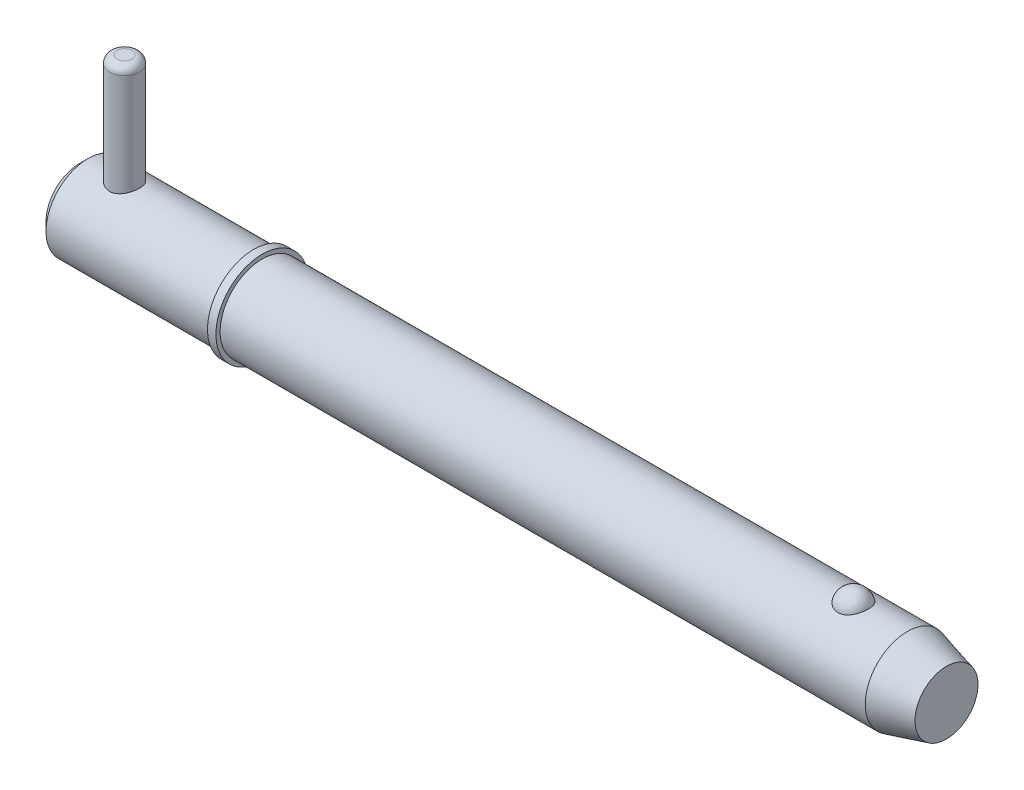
ISO-10303-21;
HEADER;
FILE_DESCRIPTION(('STEP AP214'),'2;1');
FILE_NAME('part.step','',(''),(''),'','','');
FILE_SCHEMA(('AUTOMOTIVE_DESIGN { 1 0 10303 214 1 1 1 1 }'));
ENDSEC;
DATA;
#1=APPLICATION_CONTEXT('core data for automotive mechanical design processes');
#2=APPLICATION_PROTOCOL_DEFINITION('international standard','automotive_design',2000,#1);
#3=PRODUCT_CONTEXT('',#1,'mechanical');
#4=PRODUCT('Part','Part','',(#3));
#5=PRODUCT_RELATED_PRODUCT_CATEGORY('part','',(#4));
#6=PRODUCT_DEFINITION_FORMATION('','',#4);
#7=PRODUCT_DEFINITION_CONTEXT('part definition',#1,'design');
#8=PRODUCT_DEFINITION('design','',#6,#7);
#9=PRODUCT_DEFINITION_SHAPE('','',#8);
#10=(LENGTH_UNIT() NAMED_UNIT(*) SI_UNIT(.MILLI.,.METRE.));
#11=(NAMED_UNIT(*) PLANE_ANGLE_UNIT() SI_UNIT($,.RADIAN.));
#12=(NAMED_UNIT(*) SI_UNIT($,.STERADIAN.) SOLID_ANGLE_UNIT());
#13=UNCERTAINTY_MEASURE_WITH_UNIT(LENGTH_MEASURE(1.E-05),#10,'distance_accuracy_value','');
#14=(GEOMETRIC_REPRESENTATION_CONTEXT(3) GLOBAL_UNCERTAINTY_ASSIGNED_CONTEXT((#13)) GLOBAL_UNIT_ASSIGNED_CONTEXT((#10,
#11,#12)) REPRESENTATION_CONTEXT('',''));
#15=CARTESIAN_POINT('',(0.,0.,0.));
#16=DIRECTION('',(0.,0.,1.));
#17=DIRECTION('',(1.,0.,0.));
#18=AXIS2_PLACEMENT_3D('',#15,#16,#17);
#19=CARTESIAN_POINT('',(5.94,19.845,0.));
#20=DIRECTION('',(0.,-1.,0.));
#21=DIRECTION('',(0.,0.,-1.));
#22=AXIS2_PLACEMENT_3D('',#19,#20,#21);
#23=CYLINDRICAL_SURFACE('',#22,1.98);
#24=CARTESIAN_POINT('',(5.94,-4.565,0.));
#25=DIRECTION('',(0.,1.,0.));
#26=DIRECTION('',(0.,0.,1.));
#27=AXIS2_PLACEMENT_3D('',#24,#25,#26);
#28=CIRCLE('',#27,1.98);
#29=CARTESIAN_POINT('',(5.94,-4.565,1.98));
#30=VERTEX_POINT('',#29);
#31=EDGE_CURVE('P0_E25',#30,#30,#28,.T.);
#32=ORIENTED_EDGE('',*,*,#31,.T.);
#33=EDGE_LOOP('',(#32));
#34=FACE_BOUND('',#33,.T.);
#35=CARTESIAN_POINT('',(5.94,18.855,0.));
#36=DIRECTION('',(0.,1.,0.));
#37=DIRECTION('',(0.,0.,1.));
#38=AXIS2_PLACEMENT_3D('',#35,#36,#37);
#39=CIRCLE('',#38,1.98);
#40=CARTESIAN_POINT('',(5.94,18.855,1.98));
#41=VERTEX_POINT('',#40);
#42=EDGE_CURVE('P0_E29',#41,#41,#39,.F.);
#43=ORIENTED_EDGE('',*,*,#42,.T.);
#44=EDGE_LOOP('',(#43));
#45=FACE_BOUND('',#44,.T.);
#46=ADVANCED_FACE('P0_F14',(#34,#45),#23,.T.);
#47=CARTESIAN_POINT('',(5.94,19.845,0.));
#48=DIRECTION('',(0.,1.,0.));
#49=DIRECTION('',(0.,0.,1.));
#50=AXIS2_PLACEMENT_3D('',#47,#48,#49);
#51=PLANE('',#50);
#52=CARTESIAN_POINT('',(5.94,19.845,0.));
#53=DIRECTION('',(0.,1.,0.));
#54=DIRECTION('',(0.,0.,1.));
#55=AXIS2_PLACEMENT_3D('',#52,#53,#54);
#56=CIRCLE('',#55,0.99);
#57=CARTESIAN_POINT('',(5.94,19.845,0.99));
#58=VERTEX_POINT('',#57);
#59=EDGE_CURVE('P0_E10',#58,#58,#56,.T.);
#60=ORIENTED_EDGE('',*,*,#59,.T.);
#61=EDGE_LOOP('',(#60));
#62=FACE_BOUND('',#61,.T.);
#63=ADVANCED_FACE('P0_F46',(#62),#51,.T.);
#64=CARTESIAN_POINT('',(5.94,-5.555,0.));
#65=DIRECTION('',(0.,1.,0.));
#66=DIRECTION('',(0.,0.,1.));
#67=AXIS2_PLACEMENT_3D('',#64,#65,#66);
#68=PLANE('',#67);
#69=CARTESIAN_POINT('',(5.94,-5.555,0.));
#70=DIRECTION('',(0.,1.,0.));
#71=DIRECTION('',(0.,0.,1.));
#72=AXIS2_PLACEMENT_3D('',#69,#70,#71);
#73=CIRCLE('',#72,0.99);
#74=CARTESIAN_POINT('',(5.94,-5.555,0.99));
#75=VERTEX_POINT('',#74);
#76=EDGE_CURVE('P0_E21',#75,#75,#73,.F.);
#77=ORIENTED_EDGE('',*,*,#76,.T.);
#78=EDGE_LOOP('',(#77));
#79=FACE_BOUND('',#78,.T.);
#80=ADVANCED_FACE('P0_F43',(#79),#68,.F.);
#81=CARTESIAN_POINT('',(5.94,-4.565,0.));
#82=DIRECTION('',(0.,1.,0.));
#83=DIRECTION('',(0.,0.,1.));
#84=AXIS2_PLACEMENT_3D('',#81,#82,#83);
#85=DEGENERATE_TOROIDAL_SURFACE('',#84,0.99,0.99,.T.);
#86=ORIENTED_EDGE('',*,*,#76,.F.);
#87=EDGE_LOOP('',(#86));
#88=FACE_BOUND('',#87,.T.);
#89=ORIENTED_EDGE('',*,*,#31,.F.);
#90=EDGE_LOOP('',(#89));
#91=FACE_BOUND('',#90,.T.);
#92=ADVANCED_FACE('P0_F38',(#88,#91),#85,.T.);
#93=CARTESIAN_POINT('',(5.94,18.855,0.));
#94=DIRECTION('',(0.,1.,0.));
#95=DIRECTION('',(0.,0.,1.));
#96=AXIS2_PLACEMENT_3D('',#93,#94,#95);
#97=DEGENERATE_TOROIDAL_SURFACE('',#96,0.99,0.99,.T.);
#98=ORIENTED_EDGE('',*,*,#42,.F.);
#99=EDGE_LOOP('',(#98));
#100=FACE_BOUND('',#99,.T.);
#101=ORIENTED_EDGE('',*,*,#59,.F.);
#102=EDGE_LOOP('',(#101));
#103=FACE_BOUND('',#102,.T.);
#104=ADVANCED_FACE('P0_F16',(#100,#103),#97,.T.);
#105=CLOSED_SHELL('',(#46,#63,#80,#92,#104));
#106=MANIFOLD_SOLID_BREP('P0_B1',#105);
#107=CARTESIAN_POINT('',(0.,0.,0.));
#108=DIRECTION('',(1.,0.,0.));
#109=DIRECTION('',(0.,0.,-1.));
#110=AXIS2_PLACEMENT_3D('',#107,#108,#109);
#111=CYLINDRICAL_SURFACE('',#110,5.555);
#112=CARTESIAN_POINT('',(109.417114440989,0.,0.));
#113=DIRECTION('',(1.,0.,0.));
#114=DIRECTION('',(0.,0.,-1.));
#115=AXIS2_PLACEMENT_3D('',#112,#113,#114);
#116=CIRCLE('',#115,5.555);
#117=CARTESIAN_POINT('',(109.417114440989,0.,-5.555));
#118=VERTEX_POINT('',#117);
#119=EDGE_CURVE('P1_E81',#118,#118,#116,.T.);
#120=ORIENTED_EDGE('',*,*,#119,.F.);
#121=EDGE_LOOP('',(#120));
#122=FACE_BOUND('',#121,.T.);
#123=CARTESIAN_POINT('',(24.13,0.,0.));
#124=DIRECTION('',(1.,0.,0.));
#125=DIRECTION('',(0.,0.,-1.));
#126=AXIS2_PLACEMENT_3D('',#123,#124,#125);
#127=CIRCLE('',#126,5.555);
#128=CARTESIAN_POINT('',(24.13,0.,-5.555));
#129=VERTEX_POINT('',#128);
#130=EDGE_CURVE('P1_E85',#129,#129,#127,.T.);
#131=ORIENTED_EDGE('',*,*,#130,.T.);
#132=EDGE_LOOP('',(#131));
#133=FACE_BOUND('',#132,.T.);
#134=CARTESIAN_POINT('',(102.298626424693,5.16741224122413,2.03859650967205));
#135=CARTESIAN_POINT('',(102.192949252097,5.16740893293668,2.03859990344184));
#136=CARTESIAN_POINT('',(102.08729894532,5.17079470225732,2.03008306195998));
#137=CARTESIAN_POINT('',(101.879141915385,5.18392795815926,1.9963072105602));
#138=CARTESIAN_POINT('',(101.776634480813,5.19367399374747,1.9710520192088));
#139=CARTESIAN_POINT('',(101.577771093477,5.21839168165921,1.90463997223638));
#140=CARTESIAN_POINT('',(101.481406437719,5.23335573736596,1.86350622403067));
#141=CARTESIAN_POINT('',(101.297080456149,5.26688076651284,1.76652592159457));
#142=CARTESIAN_POINT('',(101.209120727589,5.28544242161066,1.71067657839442));
#143=CARTESIAN_POINT('',(101.041265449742,5.32479845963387,1.58399959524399));
#144=CARTESIAN_POINT('',(100.96166564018,5.34564089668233,1.51279545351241));
#145=CARTESIAN_POINT('',(100.81512901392,5.38697258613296,1.35828584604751));
#146=CARTESIAN_POINT('',(100.748194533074,5.40746177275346,1.27497815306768));
#147=CARTESIAN_POINT('',(100.62561039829,5.44694508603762,1.09440293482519));
#148=CARTESIAN_POINT('',(100.570598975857,5.46583143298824,0.996677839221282));
#149=CARTESIAN_POINT('',(100.476937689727,5.49908030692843,0.792961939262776));
#150=CARTESIAN_POINT('',(100.438289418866,5.513442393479,0.686970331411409));
#151=CARTESIAN_POINT('',(100.377680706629,5.536358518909,0.468019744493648));
#152=CARTESIAN_POINT('',(100.355972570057,5.54482455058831,0.354981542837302));
#153=CARTESIAN_POINT('',(100.330636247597,5.55473324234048,0.126595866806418));
#154=CARTESIAN_POINT('',(100.327007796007,5.55617600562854,0.0112484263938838));
#155=CARTESIAN_POINT('',(100.337881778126,5.55189984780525,-0.218011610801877));
#156=CARTESIAN_POINT('',(100.352315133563,5.54620821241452,-0.331928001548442));
#157=CARTESIAN_POINT('',(100.398903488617,5.52828920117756,-0.555544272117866));
#158=CARTESIAN_POINT('',(100.431058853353,5.5160616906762,-0.665244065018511));
#159=CARTESIAN_POINT('',(100.512488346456,5.48630779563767,-0.877469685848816));
#160=CARTESIAN_POINT('',(100.561781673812,5.4687754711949,-0.979987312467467));
#161=CARTESIAN_POINT('',(100.676478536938,5.43024700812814,-1.17486975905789));
#162=CARTESIAN_POINT('',(100.741883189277,5.4092506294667,-1.26723387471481));
#163=CARTESIAN_POINT('',(100.887571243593,5.36600927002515,-1.43940133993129));
#164=CARTESIAN_POINT('',(100.967885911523,5.34376173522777,-1.5191776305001));
#165=CARTESIAN_POINT('',(101.141452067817,5.30057971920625,-1.66360338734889));
#166=CARTESIAN_POINT('',(101.234702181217,5.27964509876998,-1.72825445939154));
#167=CARTESIAN_POINT('',(101.429393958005,5.24205250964,-1.8390947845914));
#168=CARTESIAN_POINT('',(101.530590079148,5.22530519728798,-1.88568407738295));
#169=CARTESIAN_POINT('',(101.740155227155,5.19750919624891,-1.96100802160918));
#170=CARTESIAN_POINT('',(101.848521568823,5.18645838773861,-1.98974931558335));
#171=CARTESIAN_POINT('',(102.063498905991,5.17184410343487,-2.02742262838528));
#172=CARTESIAN_POINT('',(102.169925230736,5.16793282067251,-2.0372760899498));
#173=CARTESIAN_POINT('',(102.382992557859,5.1669899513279,-2.03966777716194));
#174=CARTESIAN_POINT('',(102.489633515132,5.16995704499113,-2.03220932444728));
#175=CARTESIAN_POINT('',(102.696773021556,5.18222383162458,-2.0007117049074));
#176=CARTESIAN_POINT('',(102.797359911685,5.19133213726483,-1.97717337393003));
#177=CARTESIAN_POINT('',(102.993014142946,5.21467637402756,-1.91475248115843));
#178=CARTESIAN_POINT('',(103.088081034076,5.22891272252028,-1.8758686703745));
#179=CARTESIAN_POINT('',(103.272371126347,5.26137066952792,-1.78282713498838));
#180=CARTESIAN_POINT('',(103.361419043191,5.27967329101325,-1.7283512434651));
#181=CARTESIAN_POINT('',(103.529288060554,5.31817411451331,-1.60597483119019));
#182=CARTESIAN_POINT('',(103.608106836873,5.33837274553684,-1.53807126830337));
#183=CARTESIAN_POINT('',(103.757515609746,5.37968287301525,-1.38688970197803));
#184=CARTESIAN_POINT('',(103.827505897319,5.40079011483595,-1.30301744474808));
#185=CARTESIAN_POINT('',(103.953012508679,5.44074401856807,-1.12458170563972));
#186=CARTESIAN_POINT('',(104.008526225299,5.4595902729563,-1.03001630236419));
#187=CARTESIAN_POINT('',(104.105550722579,5.49369849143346,-0.829439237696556));
#188=CARTESIAN_POINT('',(104.146548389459,5.50882422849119,-0.723155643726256));
#189=CARTESIAN_POINT('',(104.211125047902,5.53310911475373,-0.504772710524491));
#190=CARTESIAN_POINT('',(104.234703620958,5.54226812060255,-0.39267323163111));
#191=CARTESIAN_POINT('',(104.264013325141,5.55370358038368,-0.165459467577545));
#192=CARTESIAN_POINT('',(104.269688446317,5.55595843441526,-0.0503368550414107));
#193=CARTESIAN_POINT('',(104.262916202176,5.55329317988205,0.179288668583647));
#194=CARTESIAN_POINT('',(104.250469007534,5.54837313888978,0.293791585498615));
#195=CARTESIAN_POINT('',(104.207779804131,5.53189037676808,0.518526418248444));
#196=CARTESIAN_POINT('',(104.177598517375,5.5203503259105,0.628771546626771));
#197=CARTESIAN_POINT('',(104.100096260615,5.49182453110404,0.84231815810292));
#198=CARTESIAN_POINT('',(104.052774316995,5.47483847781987,0.945619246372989));
#199=CARTESIAN_POINT('',(103.941720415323,5.43710633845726,1.14281571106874));
#200=CARTESIAN_POINT('',(103.877921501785,5.41634501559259,1.23667048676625));
#201=CARTESIAN_POINT('',(103.735357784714,5.37334572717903,1.4118524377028));
#202=CARTESIAN_POINT('',(103.65659323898,5.35110778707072,1.49317982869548));
#203=CARTESIAN_POINT('',(103.486423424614,5.30779474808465,1.64049162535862));
#204=CARTESIAN_POINT('',(103.39510026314,5.28671324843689,1.70656877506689));
#205=CARTESIAN_POINT('',(103.201739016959,5.2480485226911,1.82201372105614));
#206=CARTESIAN_POINT('',(103.099700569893,5.23046541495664,1.87138095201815));
#207=CARTESIAN_POINT('',(102.883618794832,5.20042692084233,1.95335298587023));
#208=CARTESIAN_POINT('',(102.769260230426,5.18820192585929,1.98521734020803));
#209=CARTESIAN_POINT('',(102.536130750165,5.17169804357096,2.02783294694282));
#210=CARTESIAN_POINT('',(102.417361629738,5.16741595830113,2.03859269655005));
#211=CARTESIAN_POINT('',(102.298626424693,5.16741224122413,2.03859650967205));
#212=B_SPLINE_CURVE_WITH_KNOTS('',3,(#134,#135,#136,#137,#138,#139,#140,#141,#142,#143,#144,
#145,#146,#147,#148,#149,#150,#151,#152,#153,#154,#155,#156,#157,#158,#159,#160,#161,#162,#163,
#164,#165,#166,#167,#168,#169,#170,#171,#172,#173,#174,#175,#176,#177,#178,#179,#180,#181,#182,
#183,#184,#185,#186,#187,#188,#189,#190,#191,#192,#193,#194,#195,#196,#197,#198,#199,#200,#201,
#202,#203,#204,#205,#206,#207,#208,#209,#210,#211),.UNSPECIFIED.,.T.,.F.,(4,2,2,2,2,2,2,2,2,2,2,
2,2,2,2,2,2,2,2,2,2,2,2,2,2,2,2,2,2,2,2,2,2,2,2,2,2,2,4),(0.,0.316595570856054,
0.633118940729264,0.949183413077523,1.26530783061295,1.59030762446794,1.91536729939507,
2.25495824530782,2.59458224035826,2.93917283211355,3.28375835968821,3.62703002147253,
3.97030875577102,4.3139732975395,4.65766166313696,5.00207904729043,5.3464598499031,
5.68270547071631,6.0188258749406,6.33808403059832,6.65728093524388,6.96696376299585,
7.27667180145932,7.59321535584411,7.90983070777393,8.24210387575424,8.57443684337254,
8.91755896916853,9.26068933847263,9.60489211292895,9.949091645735,10.2921194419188,
10.6351667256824,10.9796305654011,11.324088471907,11.666392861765,12.0087088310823,
12.3645679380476,12.7202837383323),.UNSPECIFIED.);
#213=CARTESIAN_POINT('',(102.298626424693,5.16741224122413,2.03859650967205));
#214=VERTEX_POINT('',#213);
#215=EDGE_CURVE('P1_E35',#214,#214,#212,.T.);
#216=ORIENTED_EDGE('',*,*,#215,.T.);
#217=EDGE_LOOP('',(#216));
#218=FACE_BOUND('',#217,.T.);
#219=ADVANCED_FACE('P1_F13',(#122,#133,#218),#111,.T.);
#220=CARTESIAN_POINT('',(0.,0.,0.));
#221=DIRECTION('',(-1.,0.,0.));
#222=DIRECTION('',(0.,0.,1.));
#223=AXIS2_PLACEMENT_3D('',#220,#221,#222);
#224=PLANE('',#223);
#225=CARTESIAN_POINT('',(0.,0.,0.));
#226=DIRECTION('',(1.,0.,0.));
#227=DIRECTION('',(0.,0.,-1.));
#228=AXIS2_PLACEMENT_3D('',#225,#226,#227);
#229=CIRCLE('',#228,4.444);
#230=CARTESIAN_POINT('',(0.,0.,-4.444));
#231=VERTEX_POINT('',#230);
#232=EDGE_CURVE('P1_E9',#231,#231,#229,.T.);
#233=ORIENTED_EDGE('',*,*,#232,.F.);
#234=EDGE_LOOP('',(#233));
#235=FACE_BOUND('',#234,.T.);
#236=ADVANCED_FACE('P1_F15',(#235),#224,.T.);
#237=CARTESIAN_POINT('',(1.111,0.,0.));
#238=DIRECTION('',(1.,0.,0.));
#239=DIRECTION('',(0.,0.,-1.));
#240=AXIS2_PLACEMENT_3D('',#237,#238,#239);
#241=CONICAL_SURFACE('',#240,5.555,0.78539816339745);
#242=ORIENTED_EDGE('',*,*,#232,.T.);
#243=EDGE_LOOP('',(#242));
#244=FACE_BOUND('',#243,.T.);
#245=CARTESIAN_POINT('',(1.111,0.,0.));
#246=DIRECTION('',(1.,0.,0.));
#247=DIRECTION('',(0.,0.,-1.));
#248=AXIS2_PLACEMENT_3D('',#245,#246,#247);
#249=CIRCLE('',#248,5.555);
#250=CARTESIAN_POINT('',(1.111,0.,-5.555));
#251=VERTEX_POINT('',#250);
#252=EDGE_CURVE('P1_E26',#251,#251,#249,.T.);
#253=ORIENTED_EDGE('',*,*,#252,.F.);
#254=EDGE_LOOP('',(#253));
#255=FACE_BOUND('',#254,.T.);
#256=ADVANCED_FACE('P1_F77',(#244,#255),#241,.T.);
#257=CARTESIAN_POINT('',(0.,0.,0.));
#258=DIRECTION('',(1.,0.,0.));
#259=DIRECTION('',(0.,0.,-1.));
#260=AXIS2_PLACEMENT_3D('',#257,#258,#259);
#261=CYLINDRICAL_SURFACE('',#260,5.555);
#262=CARTESIAN_POINT('',(5.94,-5.19014691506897,1.98));
#263=CARTESIAN_POINT('',(5.83264687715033,-5.19014494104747,1.98000226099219));
#264=CARTESIAN_POINT('',(5.7253094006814,-5.19351395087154,1.97123988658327));
#265=CARTESIAN_POINT('',(5.51384517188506,-5.20654291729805,1.93656219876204));
#266=CARTESIAN_POINT('',(5.40971858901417,-5.21620320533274,1.91064598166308));
#267=CARTESIAN_POINT('',(5.20778082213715,-5.24058443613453,1.84271148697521));
#268=CARTESIAN_POINT('',(5.10995634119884,-5.25529427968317,1.80072850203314));
#269=CARTESIAN_POINT('',(4.92270352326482,-5.28810012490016,1.70197537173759));
#270=CARTESIAN_POINT('',(4.83327743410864,-5.3061970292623,1.64520128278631));
#271=CARTESIAN_POINT('',(4.66135184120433,-5.34464714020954,1.51575187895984));
#272=CARTESIAN_POINT('',(4.57928277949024,-5.36506222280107,1.44252311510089));
#273=CARTESIAN_POINT('',(4.42829115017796,-5.40532920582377,1.28342047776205));
#274=CARTESIAN_POINT('',(4.35937105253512,-5.42518099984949,1.19754423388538));
#275=CARTESIAN_POINT('',(4.23461605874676,-5.46281133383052,1.01237205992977));
#276=CARTESIAN_POINT('',(4.17924129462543,-5.48050875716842,0.912748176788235));
#277=CARTESIAN_POINT('',(4.0862117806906,-5.51109938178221,0.70485824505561));
#278=CARTESIAN_POINT('',(4.0485515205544,-5.52399407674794,0.596594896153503));
#279=CARTESIAN_POINT('',(3.99350662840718,-5.54308759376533,0.379019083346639));
#280=CARTESIAN_POINT('',(3.97538263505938,-5.54952987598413,0.269915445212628));
#281=CARTESIAN_POINT('',(3.95756405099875,-5.55586205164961,0.0500378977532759));
#282=CARTESIAN_POINT('',(3.95786404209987,-5.55575387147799,-0.060735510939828));
#283=CARTESIAN_POINT('',(3.97643665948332,-5.54915684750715,-0.275539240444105));
#284=CARTESIAN_POINT('',(3.99390415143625,-5.54295384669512,-0.379649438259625));
#285=CARTESIAN_POINT('',(4.0449721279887,-5.52523170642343,-0.583350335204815));
#286=CARTESIAN_POINT('',(4.07857373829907,-5.51371219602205,-0.682940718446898));
#287=CARTESIAN_POINT('',(4.16137312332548,-5.4863099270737,-0.876423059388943));
#288=CARTESIAN_POINT('',(4.2107826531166,-5.47036834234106,-0.970215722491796));
#289=CARTESIAN_POINT('',(4.32361427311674,-5.43575653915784,-1.1484017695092));
#290=CARTESIAN_POINT('',(4.38704062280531,-5.41708549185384,-1.23279228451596));
#291=CARTESIAN_POINT('',(4.53006791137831,-5.37778429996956,-1.39454579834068));
#292=CARTESIAN_POINT('',(4.61035105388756,-5.35710277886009,-1.4712940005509));
#293=CARTESIAN_POINT('',(4.78279835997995,-5.31692766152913,-1.6104545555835));
#294=CARTESIAN_POINT('',(4.874964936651,-5.29743430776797,-1.67286398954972));
#295=CARTESIAN_POINT('',(5.07076688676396,-5.26153775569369,-1.78259698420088));
#296=CARTESIAN_POINT('',(5.17458163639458,-5.24519780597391,-1.8296227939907));
#297=CARTESIAN_POINT('',(5.38938990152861,-5.21818744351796,-1.90530278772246));
#298=CARTESIAN_POINT('',(5.50037985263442,-5.20751423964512,-1.93396601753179));
#299=CARTESIAN_POINT('',(5.72036376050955,-5.19369176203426,-1.97077654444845));
#300=CARTESIAN_POINT('',(5.82917370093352,-5.19018851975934,-1.97989015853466));
#301=CARTESIAN_POINT('',(6.04680100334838,-5.19010609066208,-1.98010779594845));
#302=CARTESIAN_POINT('',(6.15561835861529,-5.19352540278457,-1.97121572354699));
#303=CARTESIAN_POINT('',(6.36548036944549,-5.20654623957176,-1.93654727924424));
#304=CARTESIAN_POINT('',(6.46666051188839,-5.21588705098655,-1.91148218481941));
#305=CARTESIAN_POINT('',(6.66334537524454,-5.23939939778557,-1.84605494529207));
#306=CARTESIAN_POINT('',(6.75884899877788,-5.25357186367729,-1.8056898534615));
#307=CARTESIAN_POINT('',(6.94517989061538,-5.28576258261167,-1.70921153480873));
#308=CARTESIAN_POINT('',(7.03572661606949,-5.30389804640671,-1.65259670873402));
#309=CARTESIAN_POINT('',(7.20638087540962,-5.34176077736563,-1.52577523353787));
#310=CARTESIAN_POINT('',(7.28648490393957,-5.36148857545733,-1.45556404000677));
#311=CARTESIAN_POINT('',(7.43864697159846,-5.40165494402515,-1.2988614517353));
#312=CARTESIAN_POINT('',(7.50999887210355,-5.42207106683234,-1.21167640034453));
#313=CARTESIAN_POINT('',(7.63712639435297,-5.46023601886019,-1.026066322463));
#314=CARTESIAN_POINT('',(7.69290228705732,-5.47798489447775,-0.927641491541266));
#315=CARTESIAN_POINT('',(7.78684673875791,-5.50876590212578,-0.722633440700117));
#316=CARTESIAN_POINT('',(7.82510508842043,-5.52182201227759,-0.616095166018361));
#317=CARTESIAN_POINT('',(7.88297051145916,-5.54184206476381,-0.397530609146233));
#318=CARTESIAN_POINT('',(7.90258540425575,-5.5488085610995,-0.285506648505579));
#319=CARTESIAN_POINT('',(7.9218262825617,-5.55564472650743,-0.065566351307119));
#320=CARTESIAN_POINT('',(7.92245987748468,-5.55587212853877,0.0422515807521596));
#321=CARTESIAN_POINT('',(7.90626329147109,-5.55011340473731,0.256387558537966));
#322=CARTESIAN_POINT('',(7.88943488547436,-5.54412791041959,0.362705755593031));
#323=CARTESIAN_POINT('',(7.83948457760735,-5.52676548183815,0.568649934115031));
#324=CARTESIAN_POINT('',(7.8067003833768,-5.51550046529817,0.668367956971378));
#325=CARTESIAN_POINT('',(7.72609369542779,-5.48874437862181,0.860911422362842));
#326=CARTESIAN_POINT('',(7.67826838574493,-5.47325251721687,0.953735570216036));
#327=CARTESIAN_POINT('',(7.56675024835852,-5.43884382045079,1.13391068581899));
#328=CARTESIAN_POINT('',(7.50249968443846,-5.41981485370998,1.22089468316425));
#329=CARTESIAN_POINT('',(7.36086495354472,-5.38069275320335,1.38316665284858));
#330=CARTESIAN_POINT('',(7.28347630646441,-5.36059925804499,1.45845061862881));
#331=CARTESIAN_POINT('',(7.11347587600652,-5.32048380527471,1.59876646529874));
#332=CARTESIAN_POINT('',(7.02032386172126,-5.30050854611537,1.66315951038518));
#333=CARTESIAN_POINT('',(6.82388804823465,-5.26398994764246,1.77536801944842));
#334=CARTESIAN_POINT('',(6.7206049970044,-5.24744635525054,1.82318470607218));
#335=CARTESIAN_POINT('',(6.50639706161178,-5.21987969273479,1.90068230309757));
#336=CARTESIAN_POINT('',(6.3954529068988,-5.20887116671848,1.93031547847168));
#337=CARTESIAN_POINT('',(6.16966522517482,-5.19400760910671,1.96996824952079));
#338=CARTESIAN_POINT('',(6.05482366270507,-5.19014902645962,1.97999758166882));
#339=CARTESIAN_POINT('',(5.94,-5.19014691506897,1.98));
#340=B_SPLINE_CURVE_WITH_KNOTS('',3,(#262,#263,#264,#265,#266,#267,#268,#269,#270,#271,#272,
#273,#274,#275,#276,#277,#278,#279,#280,#281,#282,#283,#284,#285,#286,#287,#288,#289,#290,#291,
#292,#293,#294,#295,#296,#297,#298,#299,#300,#301,#302,#303,#304,#305,#306,#307,#308,#309,#310,
#311,#312,#313,#314,#315,#316,#317,#318,#319,#320,#321,#322,#323,#324,#325,#326,#327,#328,#329,
#330,#331,#332,#333,#334,#335,#336,#337,#338,#339),.UNSPECIFIED.,.T.,.F.,(4,2,2,2,2,2,2,2,2,2,2,
2,2,2,2,2,2,2,2,2,2,2,2,2,2,2,2,2,2,2,2,2,2,2,2,2,2,2,4),(0.,0.321632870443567,
0.643282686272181,0.964229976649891,1.28526292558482,1.61937087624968,1.9535415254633,
2.29784481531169,2.64204093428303,2.97269632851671,3.30325448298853,3.61901541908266,
3.93479838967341,4.25500220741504,4.57530346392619,4.91268648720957,5.25013812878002,
5.59378026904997,5.93725299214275,6.26331481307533,6.58930593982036,6.90185604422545,
7.21446637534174,7.53801472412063,7.86167140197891,8.20353561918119,8.54539388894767,
8.88547970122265,9.22542281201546,9.54728637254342,9.86911722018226,10.1844146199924,
10.4997710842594,10.827730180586,11.1558013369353,11.499115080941,11.8424034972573,
12.1865892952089,12.5306041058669),.UNSPECIFIED.);
#341=CARTESIAN_POINT('',(5.94,-5.19014691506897,1.98));
#342=VERTEX_POINT('',#341);
#343=EDGE_CURVE('P1_E17',#342,#342,#340,.T.);
#344=ORIENTED_EDGE('',*,*,#343,.F.);
#345=EDGE_LOOP('',(#344));
#346=FACE_BOUND('',#345,.T.);
#347=CARTESIAN_POINT('',(5.94,5.19014691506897,1.98));
#348=CARTESIAN_POINT('',(6.04735312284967,5.19014494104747,1.98000226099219));
#349=CARTESIAN_POINT('',(6.1546905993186,5.19351395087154,1.97123988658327));
#350=CARTESIAN_POINT('',(6.36615482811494,5.20654291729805,1.93656219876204));
#351=CARTESIAN_POINT('',(6.47028141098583,5.21620320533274,1.91064598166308));
#352=CARTESIAN_POINT('',(6.67221917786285,5.24058443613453,1.84271148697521));
#353=CARTESIAN_POINT('',(6.77004365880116,5.25529427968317,1.80072850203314));
#354=CARTESIAN_POINT('',(6.95729647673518,5.28810012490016,1.70197537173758));
#355=CARTESIAN_POINT('',(7.04672256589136,5.3061970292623,1.64520128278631));
#356=CARTESIAN_POINT('',(7.21864815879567,5.34464714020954,1.51575187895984));
#357=CARTESIAN_POINT('',(7.30071722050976,5.36506222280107,1.44252311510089));
#358=CARTESIAN_POINT('',(7.45170884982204,5.40532920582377,1.28342047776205));
#359=CARTESIAN_POINT('',(7.52062894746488,5.42518099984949,1.19754423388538));
#360=CARTESIAN_POINT('',(7.64538394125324,5.46281133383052,1.01237205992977));
#361=CARTESIAN_POINT('',(7.70075870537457,5.48050875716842,0.912748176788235));
#362=CARTESIAN_POINT('',(7.7937882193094,5.51109938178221,0.704858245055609));
#363=CARTESIAN_POINT('',(7.8314484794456,5.52399407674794,0.596594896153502));
#364=CARTESIAN_POINT('',(7.88649337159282,5.54308759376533,0.379019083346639));
#365=CARTESIAN_POINT('',(7.90461736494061,5.54952987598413,0.269915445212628));
#366=CARTESIAN_POINT('',(7.92243594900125,5.55586205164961,0.0500378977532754));
#367=CARTESIAN_POINT('',(7.92213595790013,5.55575387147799,-0.0607355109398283));
#368=CARTESIAN_POINT('',(7.90356334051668,5.54915684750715,-0.275539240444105));
#369=CARTESIAN_POINT('',(7.88609584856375,5.54295384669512,-0.379649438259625));
#370=CARTESIAN_POINT('',(7.8350278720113,5.52523170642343,-0.583350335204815));
#371=CARTESIAN_POINT('',(7.80142626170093,5.51371219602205,-0.682940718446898));
#372=CARTESIAN_POINT('',(7.71862687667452,5.4863099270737,-0.876423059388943));
#373=CARTESIAN_POINT('',(7.6692173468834,5.47036834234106,-0.970215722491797));
#374=CARTESIAN_POINT('',(7.55638572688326,5.43575653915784,-1.1484017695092));
#375=CARTESIAN_POINT('',(7.49295937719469,5.41708549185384,-1.23279228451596));
#376=CARTESIAN_POINT('',(7.34993208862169,5.37778429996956,-1.39454579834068));
#377=CARTESIAN_POINT('',(7.26964894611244,5.35710277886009,-1.4712940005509));
#378=CARTESIAN_POINT('',(7.09720164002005,5.31692766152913,-1.6104545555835));
#379=CARTESIAN_POINT('',(7.00503506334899,5.29743430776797,-1.67286398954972));
#380=CARTESIAN_POINT('',(6.80923311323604,5.26153775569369,-1.78259698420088));
#381=CARTESIAN_POINT('',(6.70541836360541,5.24519780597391,-1.8296227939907));
#382=CARTESIAN_POINT('',(6.49061009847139,5.21818744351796,-1.90530278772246));
#383=CARTESIAN_POINT('',(6.37962014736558,5.20751423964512,-1.93396601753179));
#384=CARTESIAN_POINT('',(6.15963623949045,5.19369176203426,-1.97077654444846));
#385=CARTESIAN_POINT('',(6.05082629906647,5.19018851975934,-1.97989015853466));
#386=CARTESIAN_POINT('',(5.83319899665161,5.19010609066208,-1.98010779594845));
#387=CARTESIAN_POINT('',(5.7243816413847,5.19352540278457,-1.97121572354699));
#388=CARTESIAN_POINT('',(5.5145196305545,5.20654623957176,-1.93654727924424));
#389=CARTESIAN_POINT('',(5.4133394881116,5.21588705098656,-1.91148218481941));
#390=CARTESIAN_POINT('',(5.21665462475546,5.23939939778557,-1.84605494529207));
#391=CARTESIAN_POINT('',(5.12115100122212,5.25357186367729,-1.8056898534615));
#392=CARTESIAN_POINT('',(4.93482010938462,5.28576258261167,-1.70921153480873));
#393=CARTESIAN_POINT('',(4.84427338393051,5.30389804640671,-1.65259670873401));
#394=CARTESIAN_POINT('',(4.67361912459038,5.34176077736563,-1.52577523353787));
#395=CARTESIAN_POINT('',(4.59351509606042,5.36148857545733,-1.45556404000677));
#396=CARTESIAN_POINT('',(4.44135302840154,5.40165494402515,-1.2988614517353));
#397=CARTESIAN_POINT('',(4.37000112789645,5.42207106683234,-1.21167640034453));
#398=CARTESIAN_POINT('',(4.24287360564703,5.46023601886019,-1.026066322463));
#399=CARTESIAN_POINT('',(4.18709771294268,5.47798489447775,-0.927641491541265));
#400=CARTESIAN_POINT('',(4.09315326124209,5.50876590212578,-0.722633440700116));
#401=CARTESIAN_POINT('',(4.05489491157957,5.52182201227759,-0.61609516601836));
#402=CARTESIAN_POINT('',(3.99702948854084,5.54184206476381,-0.397530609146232));
#403=CARTESIAN_POINT('',(3.97741459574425,5.5488085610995,-0.285506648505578));
#404=CARTESIAN_POINT('',(3.9581737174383,5.55564472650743,-0.0655663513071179));
#405=CARTESIAN_POINT('',(3.95754012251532,5.55587212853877,0.0422515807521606));
#406=CARTESIAN_POINT('',(3.97373670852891,5.55011340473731,0.256387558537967));
#407=CARTESIAN_POINT('',(3.99056511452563,5.54412791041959,0.362705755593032));
#408=CARTESIAN_POINT('',(4.04051542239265,5.52676548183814,0.568649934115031));
#409=CARTESIAN_POINT('',(4.07329961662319,5.51550046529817,0.668367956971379));
#410=CARTESIAN_POINT('',(4.15390630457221,5.48874437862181,0.860911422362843));
#411=CARTESIAN_POINT('',(4.20173161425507,5.47325251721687,0.953735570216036));
#412=CARTESIAN_POINT('',(4.31324975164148,5.43884382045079,1.13391068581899));
#413=CARTESIAN_POINT('',(4.37750031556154,5.41981485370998,1.22089468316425));
#414=CARTESIAN_POINT('',(4.51913504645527,5.38069275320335,1.38316665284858));
#415=CARTESIAN_POINT('',(4.59652369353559,5.36059925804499,1.45845061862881));
#416=CARTESIAN_POINT('',(4.76652412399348,5.32048380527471,1.59876646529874));
#417=CARTESIAN_POINT('',(4.85967613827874,5.30050854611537,1.66315951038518));
#418=CARTESIAN_POINT('',(5.05611195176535,5.26398994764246,1.77536801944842));
#419=CARTESIAN_POINT('',(5.1593950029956,5.24744635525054,1.82318470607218));
#420=CARTESIAN_POINT('',(5.37360293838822,5.21987969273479,1.90068230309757));
#421=CARTESIAN_POINT('',(5.4845470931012,5.20887116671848,1.93031547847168));
#422=CARTESIAN_POINT('',(5.71033477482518,5.19400760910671,1.96996824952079));
#423=CARTESIAN_POINT('',(5.82517633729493,5.19014902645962,1.97999758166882));
#424=CARTESIAN_POINT('',(5.94,5.19014691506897,1.98));
#425=B_SPLINE_CURVE_WITH_KNOTS('',3,(#347,#348,#349,#350,#351,#352,#353,#354,#355,#356,#357,
#358,#359,#360,#361,#362,#363,#364,#365,#366,#367,#368,#369,#370,#371,#372,#373,#374,#375,#376,
#377,#378,#379,#380,#381,#382,#383,#384,#385,#386,#387,#388,#389,#390,#391,#392,#393,#394,#395,
#396,#397,#398,#399,#400,#401,#402,#403,#404,#405,#406,#407,#408,#409,#410,#411,#412,#413,#414,
#415,#416,#417,#418,#419,#420,#421,#422,#423,#424),.UNSPECIFIED.,.T.,.F.,(4,2,2,2,2,2,2,2,2,2,2,
2,2,2,2,2,2,2,2,2,2,2,2,2,2,2,2,2,2,2,2,2,2,2,2,2,2,2,4),(0.,0.321632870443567,
0.643282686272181,0.964229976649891,1.28526292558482,1.61937087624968,1.9535415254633,
2.29784481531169,2.64204093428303,2.97269632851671,3.30325448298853,3.61901541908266,
3.93479838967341,4.25500220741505,4.57530346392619,4.91268648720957,5.25013812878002,
5.59378026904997,5.93725299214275,6.26331481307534,6.58930593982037,6.90185604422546,
7.21446637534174,7.53801472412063,7.86167140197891,8.20353561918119,8.54539388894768,
8.88547970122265,9.22542281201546,9.54728637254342,9.86911722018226,10.1844146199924,
10.4997710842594,10.827730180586,11.1558013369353,11.499115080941,11.8424034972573,
12.1865892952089,12.5306041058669),.UNSPECIFIED.);
#426=CARTESIAN_POINT('',(5.94,5.19014691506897,1.98));
#427=VERTEX_POINT('',#426);
#428=EDGE_CURVE('P1_E43',#427,#427,#425,.T.);
#429=ORIENTED_EDGE('',*,*,#428,.F.);
#430=EDGE_LOOP('',(#429));
#431=FACE_BOUND('',#430,.T.);
#432=ORIENTED_EDGE('',*,*,#252,.T.);
#433=EDGE_LOOP('',(#432));
#434=FACE_BOUND('',#433,.T.);
#435=CARTESIAN_POINT('',(23.019,0.,0.));
#436=DIRECTION('',(1.,0.,0.));
#437=DIRECTION('',(0.,0.,-1.));
#438=AXIS2_PLACEMENT_3D('',#435,#436,#437);
#439=CIRCLE('',#438,5.555);
#440=CARTESIAN_POINT('',(23.019,0.,-5.555));
#441=VERTEX_POINT('',#440);
#442=EDGE_CURVE('P1_E31',#441,#441,#439,.T.);
#443=ORIENTED_EDGE('',*,*,#442,.F.);
#444=EDGE_LOOP('',(#443));
#445=FACE_BOUND('',#444,.T.);
#446=ADVANCED_FACE('P1_F103',(#346,#431,#434,#445),#261,.T.);
#447=CARTESIAN_POINT('',(23.019,5.555,0.));
#448=DIRECTION('',(-1.,0.,0.));
#449=DIRECTION('',(0.,0.,1.));
#450=AXIS2_PLACEMENT_3D('',#447,#448,#449);
#451=PLANE('',#450);
#452=ORIENTED_EDGE('',*,*,#442,.T.);
#453=EDGE_LOOP('',(#452));
#454=FACE_BOUND('',#453,.T.);
#455=CARTESIAN_POINT('',(23.019,0.,0.));
#456=DIRECTION('',(1.,0.,0.));
#457=DIRECTION('',(0.,0.,-1.));
#458=AXIS2_PLACEMENT_3D('',#455,#456,#457);
#459=CIRCLE('',#458,6.1105);
#460=CARTESIAN_POINT('',(23.019,0.,-6.1105));
#461=VERTEX_POINT('',#460);
#462=EDGE_CURVE('P1_E91',#461,#461,#459,.T.);
#463=ORIENTED_EDGE('',*,*,#462,.F.);
#464=EDGE_LOOP('',(#463));
#465=FACE_BOUND('',#464,.T.);
#466=ADVANCED_FACE('P1_F100',(#454,#465),#451,.T.);
#467=CARTESIAN_POINT('',(0.,0.,0.));
#468=DIRECTION('',(1.,0.,0.));
#469=DIRECTION('',(0.,0.,-1.));
#470=AXIS2_PLACEMENT_3D('',#467,#468,#469);
#471=CYLINDRICAL_SURFACE('',#470,6.1105);
#472=ORIENTED_EDGE('',*,*,#462,.T.);
#473=EDGE_LOOP('',(#472));
#474=FACE_BOUND('',#473,.T.);
#475=CARTESIAN_POINT('',(24.13,0.,0.));
#476=DIRECTION('',(1.,0.,0.));
#477=DIRECTION('',(0.,0.,-1.));
#478=AXIS2_PLACEMENT_3D('',#475,#476,#477);
#479=CIRCLE('',#478,6.1105);
#480=CARTESIAN_POINT('',(24.13,0.,-6.1105));
#481=VERTEX_POINT('',#480);
#482=EDGE_CURVE('P1_E88',#481,#481,#479,.T.);
#483=ORIENTED_EDGE('',*,*,#482,.F.);
#484=EDGE_LOOP('',(#483));
#485=FACE_BOUND('',#484,.T.);
#486=ADVANCED_FACE('P1_F68',(#474,#485),#471,.T.);
#487=CARTESIAN_POINT('',(24.13,6.1105,0.));
#488=DIRECTION('',(1.,0.,0.));
#489=DIRECTION('',(0.,0.,-1.));
#490=AXIS2_PLACEMENT_3D('',#487,#488,#489);
#491=PLANE('',#490);
#492=ORIENTED_EDGE('',*,*,#482,.T.);
#493=EDGE_LOOP('',(#492));
#494=FACE_BOUND('',#493,.T.);
#495=ORIENTED_EDGE('',*,*,#130,.F.);
#496=EDGE_LOOP('',(#495));
#497=FACE_BOUND('',#496,.T.);
#498=ADVANCED_FACE('P1_F62',(#494,#497),#491,.T.);
#499=CARTESIAN_POINT('',(114.6,0.,0.));
#500=DIRECTION('',(-1.,0.,0.));
#501=DIRECTION('',(0.,0.,1.));
#502=AXIS2_PLACEMENT_3D('',#499,#500,#501);
#503=CONICAL_SURFACE('',#502,4.16625000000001,0.26179938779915);
#504=ORIENTED_EDGE('',*,*,#119,.T.);
#505=EDGE_LOOP('',(#504));
#506=FACE_BOUND('',#505,.T.);
#507=CARTESIAN_POINT('',(114.6,0.,0.));
#508=DIRECTION('',(1.,0.,0.));
#509=DIRECTION('',(0.,0.,-1.));
#510=AXIS2_PLACEMENT_3D('',#507,#508,#509);
#511=CIRCLE('',#510,4.16625000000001);
#512=CARTESIAN_POINT('',(114.6,0.,-4.16625000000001));
#513=VERTEX_POINT('',#512);
#514=EDGE_CURVE('P1_E42',#513,#513,#511,.T.);
#515=ORIENTED_EDGE('',*,*,#514,.F.);
#516=EDGE_LOOP('',(#515));
#517=FACE_BOUND('',#516,.T.);
#518=ADVANCED_FACE('P1_F59',(#506,#517),#503,.T.);
#519=CARTESIAN_POINT('',(114.6,4.16625000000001,0.));
#520=DIRECTION('',(1.,0.,0.));
#521=DIRECTION('',(0.,0.,-1.));
#522=AXIS2_PLACEMENT_3D('',#519,#520,#521);
#523=PLANE('',#522);
#524=ORIENTED_EDGE('',*,*,#514,.T.);
#525=EDGE_LOOP('',(#524));
#526=FACE_BOUND('',#525,.T.);
#527=ADVANCED_FACE('P1_F55',(#526),#523,.T.);
#528=CARTESIAN_POINT('',(102.298626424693,4.9995,0.));
#529=DIRECTION('',(-1.,0.,0.));
#530=DIRECTION('',(0.,1.,0.));
#531=AXIS2_PLACEMENT_3D('',#528,#529,#530);
#532=SPHERICAL_SURFACE('',#531,2.04549999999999);
#533=ORIENTED_EDGE('',*,*,#215,.F.);
#534=EDGE_LOOP('',(#533));
#535=FACE_BOUND('',#534,.T.);
#536=ADVANCED_FACE('P1_F50',(#535),#532,.T.);
#537=CARTESIAN_POINT('',(5.94,-6.1105,0.));
#538=DIRECTION('',(0.,1.,0.));
#539=DIRECTION('',(0.,0.,1.));
#540=AXIS2_PLACEMENT_3D('',#537,#538,#539);
#541=CYLINDRICAL_SURFACE('',#540,1.98);
#542=ORIENTED_EDGE('',*,*,#343,.T.);
#543=EDGE_LOOP('',(#542));
#544=FACE_BOUND('',#543,.T.);
#545=ORIENTED_EDGE('',*,*,#428,.T.);
#546=EDGE_LOOP('',(#545));
#547=FACE_BOUND('',#546,.T.);
#548=ADVANCED_FACE('P1_F54',(#544,#547),#541,.F.);
#549=CLOSED_SHELL('',(#219,#236,#256,#446,#466,#486,#498,#518,#527,#536,#548));
#550=MANIFOLD_SOLID_BREP('P1_B1',#549);
#551=ADVANCED_BREP_SHAPE_REPRESENTATION('',(#18,#106,#550),#14);
#552=SHAPE_DEFINITION_REPRESENTATION(#9,#551);
ENDSEC;
END-ISO-10303-21;
